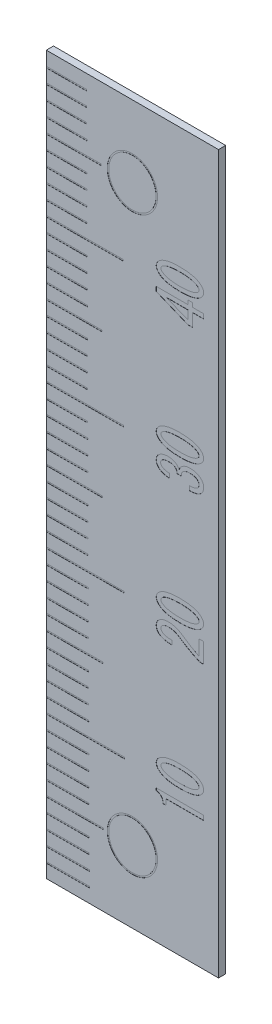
from build123d import *

# Parameters (mm, degrees)
SKETCH1_W      = 12
SKETCH1_H      = 50
EXTRUDE1_DEPTH = 0.5
SKETCH2_R      = 1.75
SKETCH2_R_2    = 1.65
EXTRUDE2_DEPTH = 0.01
EXTRUDE3_DEPTH = 0.01
EXTRUDE4_DEPTH = 0.01


with BuildPart() as part:
    # Sketch1 → Extrude1 (new body)
    with BuildSketch(Plane.XY):
        with Locations((6, 25)):
            Rectangle(SKETCH1_W, SKETCH1_H)
    extrude(amount=EXTRUDE1_DEPTH)

    # Sketch2 → Extrude2 (cut)
    # profile 1 of 2: a face of its own
    with BuildSketch(Plane.XY.offset(0.5)):
        with Locations((6, 5)):
            Circle(SKETCH2_R)
        with Locations((6, 5)):
            Circle(SKETCH2_R_2, mode=Mode.SUBTRACT)
    # profile 2 of 2: a face of its own
    with BuildSketch(Plane.XY.offset(0.5)):
        with Locations((6, 45)):
            Circle(SKETCH2_R)
        with Locations((6, 45)):
            Circle(SKETCH2_R_2, mode=Mode.SUBTRACT)
    extrude(amount=-EXTRUDE2_DEPTH, mode=Mode.SUBTRACT)

    # Sketch3 → Extrude3 (cut)
    # profile 1 of 8: a face of its own
    with BuildSketch(Plane.XY.offset(0.5)):
        Polygon((10.964202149, 39.253595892), (10.576078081, 39.253595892), (10.18481385, 39.253595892), (10.18481385, 38.358021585), (9.863889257, 38.358021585), (7.659495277, 39.263016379), (7.659495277, 39.57326442), (9.863889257, 39.57326442), (9.863889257, 39.857135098), (10.18481385, 39.857135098), (10.18481385, 39.57326442), (10.964202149, 39.57326442), align=None)
        Polygon((9.863889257, 39.253595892), (8.371684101, 39.253595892), (9.863889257, 38.655080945), align=None, mode=Mode.SUBTRACT)
    # profile 2 of 8: a face of its own
    with BuildSketch(Plane.XY.offset(0.5)):
        with BuildLine():
            add(Edge.make_bspline(
                [(9.304312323, 40.08636695), (9.263487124, 40.086598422), (9.183284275, 40.087053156), (9.065184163, 40.090916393), (8.951677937, 40.097059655), (8.842790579, 40.105920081), (8.738418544, 40.116877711), (8.638826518, 40.131643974), (8.543659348, 40.147711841), (8.453367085, 40.166540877), (8.367534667, 40.187646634), (8.286660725, 40.212475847), (8.209981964, 40.238496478), (8.13792646, 40.267351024), (8.071052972, 40.299483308), (8.008231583, 40.333293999), (7.950513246, 40.370357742), (7.914537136, 40.397244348), (7.896891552, 40.410431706)],
                knots=[0, 0, 0, 0, 1.334199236, 2.621091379, 3.861325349, 5.048806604, 6.191184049, 7.29033474, 8.338632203, 9.344988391, 10.304094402, 11.226124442, 12.10888774, 12.949942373, 13.760906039, 14.53244093, 15.280190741, 16, 16, 16, 16], degree=3))
            add(Edge.make_bspline(
                [(7.896891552, 40.410431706), (7.877886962, 40.425936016), (7.841081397, 40.455962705), (7.793642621, 40.506288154), (7.75209867, 40.556343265), (7.718531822, 40.608467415), (7.691781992, 40.661574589), (7.673561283, 40.716630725), (7.661657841, 40.77250316), (7.660214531, 40.810429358), (7.659495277, 40.829329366)],
                knots=[0, 0, 0, 0, 1.179273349, 2.283859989, 3.322502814, 4.306324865, 5.261663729, 6.17616916, 7.091118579, 8, 8, 8, 8], degree=3))
            add(Edge.make_bspline(
                [(7.659495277, 40.829329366), (7.660212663, 40.848230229), (7.661652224, 40.886158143), (7.67358392, 40.942017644), (7.691636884, 40.996945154), (7.718688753, 41.049705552), (7.752296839, 41.101723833), (7.793217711, 41.152330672), (7.841340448, 41.202029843), (7.877935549, 41.232049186), (7.896891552, 41.247598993)],
                knots=[0, 0, 0, 0, 0.909839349, 1.825753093, 2.741222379, 3.688535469, 4.673394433, 5.720979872, 6.819483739, 8, 8, 8, 8], degree=3))
            add(Edge.make_bspline(
                [(7.896891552, 41.247598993), (7.914537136, 41.260786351), (7.950513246, 41.287672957), (8.008231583, 41.3247367), (8.071052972, 41.358547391), (8.13792646, 41.390679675), (8.209981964, 41.419534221), (8.286660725, 41.445554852), (8.367534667, 41.470384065), (8.453367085, 41.491489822), (8.543659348, 41.510318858), (8.638826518, 41.526386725), (8.738418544, 41.541152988), (8.842790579, 41.552110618), (8.951677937, 41.560971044), (9.065184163, 41.567114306), (9.183284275, 41.570977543), (9.263487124, 41.571432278), (9.304312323, 41.571663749)],
                knots=[0, 0, 0, 0, 0.719809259, 1.46755907, 2.239093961, 3.050057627, 3.89111226, 4.773875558, 5.695905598, 6.655011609, 7.661367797, 8.70966526, 9.808815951, 10.951193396, 12.138674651, 13.378908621, 14.665800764, 16, 16, 16, 16], degree=3))
            add(Edge.make_bspline(
                [(9.304312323, 41.571663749), (9.345974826, 41.571432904), (9.427642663, 41.570980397), (9.547627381, 41.567132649), (9.662805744, 41.560946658), (9.773365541, 41.552091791), (9.879218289, 41.541255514), (9.980042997, 41.52631378), (10.076267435, 41.510328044), (10.167806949, 41.49146689), (10.25471717, 41.470480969), (10.336402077, 41.445542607), (10.413707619, 41.419531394), (10.486394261, 41.390685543), (10.553875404, 41.358519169), (10.617234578, 41.324907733), (10.675058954, 41.28765614), (10.711041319, 41.260780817), (10.728689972, 41.247598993)],
                knots=[0, 0, 0, 0, 1.346341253, 2.639130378, 3.8790076, 5.073442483, 6.223226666, 7.316783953, 8.366697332, 9.375051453, 10.336565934, 11.254764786, 12.134057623, 12.971986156, 13.779994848, 14.548849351, 15.288238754, 16, 16, 16, 16], degree=3))
            add(Edge.make_bspline(
                [(10.728689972, 41.247598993), (10.747351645, 41.231964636), (10.783604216, 41.201592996), (10.832476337, 41.152791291), (10.872490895, 41.101447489), (10.906527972, 41.049937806), (10.932289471, 40.996615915), (10.951811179, 40.942259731), (10.962410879, 40.886054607), (10.964024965, 40.848209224), (10.964830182, 40.829329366)],
                knots=[0, 0, 0, 0, 1.1743338, 2.28128622, 3.323893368, 4.309986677, 5.254013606, 6.173907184, 7.08902033, 8, 8, 8, 8], degree=3))
            add(Edge.make_bspline(
                [(10.964830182, 40.829329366), (10.964023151, 40.81045032), (10.962405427, 40.772606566), (10.95183315, 40.716389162), (10.932141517, 40.661902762), (10.906685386, 40.608236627), (10.872691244, 40.556620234), (10.832051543, 40.505827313), (10.783860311, 40.456400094), (10.747399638, 40.426020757), (10.728689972, 40.410431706)],
                knots=[0, 0, 0, 0, 0.910025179, 1.824179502, 2.743109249, 3.69522398, 4.680284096, 5.713901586, 6.826896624, 8, 8, 8, 8], degree=3))
            add(Edge.make_bspline(
                [(10.728689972, 40.410431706), (10.711041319, 40.397249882), (10.675058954, 40.370374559), (10.617234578, 40.333122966), (10.553875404, 40.29951153), (10.486394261, 40.267345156), (10.413707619, 40.238499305), (10.336402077, 40.212488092), (10.25471717, 40.18754973), (10.167806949, 40.166563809), (10.076267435, 40.147702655), (9.980042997, 40.131716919), (9.879218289, 40.116775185), (9.773365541, 40.105938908), (9.662805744, 40.097084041), (9.547627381, 40.09089805), (9.427642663, 40.087050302), (9.345974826, 40.086597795), (9.304312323, 40.08636695)],
                knots=[0, 0, 0, 0, 0.711761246, 1.451150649, 2.220005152, 3.028013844, 3.865942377, 4.745235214, 5.663434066, 6.624948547, 7.633302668, 8.683216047, 9.776773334, 10.926557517, 12.1209924, 13.360869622, 14.653658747, 16, 16, 16, 16], degree=3))
        make_face()
        with BuildLine():
            add(Edge.make_bspline(
                [(9.304312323, 41.261415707), (9.267676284, 41.261069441), (9.195861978, 41.260390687), (9.090316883, 41.258165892), (8.989150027, 41.253278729), (8.892481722, 41.245290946), (8.80022693, 41.237179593), (8.712814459, 41.225295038), (8.629718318, 41.213328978), (8.551258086, 41.197943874), (8.47692929, 41.181420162), (8.407398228, 41.16150603), (8.341873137, 41.141413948), (8.281453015, 41.117852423), (8.225379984, 41.092883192), (8.173815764, 41.065786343), (8.126168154, 41.037204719), (8.097468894, 41.015283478), (8.083417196, 41.004550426)],
                knots=[0, 0, 0, 0, 1.387476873, 2.71974516, 3.997715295, 5.222316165, 6.392993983, 7.5041764, 8.562605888, 9.571696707, 10.531368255, 11.445041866, 12.310057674, 13.125709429, 13.899281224, 14.633331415, 15.330853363, 16, 16, 16, 16], degree=3))
            add(Edge.make_bspline(
                [(8.083417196, 41.004550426), (8.067942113, 40.991309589), (8.038992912, 40.966539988), (8.006840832, 40.922559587), (7.985224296, 40.87705391), (7.982844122, 40.845041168), (7.981675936, 40.829329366)],
                knots=[0, 0, 0, 0, 1.162721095, 2.175099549, 3.10434177, 4, 4, 4, 4], degree=3))
            add(Edge.make_bspline(
                [(7.981675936, 40.829329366), (7.982836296, 40.813611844), (7.985200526, 40.781587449), (8.007018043, 40.736019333), (8.038753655, 40.691521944), (8.067903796, 40.666693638), (8.083417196, 40.653480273)],
                knots=[0, 0, 0, 0, 0.893494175, 1.820491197, 2.840088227, 4, 4, 4, 4], degree=3))
            add(Edge.make_bspline(
                [(8.083417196, 40.653480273), (8.098156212, 40.643035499), (8.128454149, 40.621564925), (8.177291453, 40.592299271), (8.230299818, 40.565060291), (8.287887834, 40.540907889), (8.349363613, 40.517529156), (8.415145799, 40.496237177), (8.485227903, 40.477516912), (8.559390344, 40.460570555), (8.637959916, 40.445608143), (8.720652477, 40.432335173), (8.807623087, 40.421817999), (8.898748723, 40.413272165), (8.994176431, 40.405404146), (9.093874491, 40.400498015), (9.197746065, 40.398267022), (9.268304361, 40.397589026), (9.304312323, 40.397243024)],
                knots=[0, 0, 0, 0, 0.684573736, 1.407229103, 2.156074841, 2.941731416, 3.772993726, 4.648817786, 5.561264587, 6.521855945, 7.531913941, 8.592575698, 9.69595549, 10.851956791, 12.06190895, 13.325252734, 14.634998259, 16, 16, 16, 16], degree=3))
            add(Edge.make_bspline(
                [(9.304312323, 40.397243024), (9.341785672, 40.397588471), (9.415065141, 40.398263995), (9.522703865, 40.400490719), (9.625541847, 40.405385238), (9.723691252, 40.413273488), (9.817323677, 40.421841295), (9.906404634, 40.432229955), (9.990753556, 40.445635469), (10.070391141, 40.460491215), (10.145369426, 40.477539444), (10.215901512, 40.496147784), (10.281702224, 40.517419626), (10.342729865, 40.540898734), (10.399661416, 40.565104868), (10.451853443, 40.591966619), (10.49904188, 40.621590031), (10.528053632, 40.643045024), (10.542164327, 40.653480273)],
                knots=[0, 0, 0, 0, 1.401046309, 2.739758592, 4.0248449, 5.249399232, 6.420696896, 7.540008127, 8.601571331, 9.613140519, 10.568176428, 11.475655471, 12.339456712, 13.151990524, 13.919674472, 14.651282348, 15.344012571, 16, 16, 16, 16], degree=3))
            add(Edge.make_bspline(
                [(10.542164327, 40.653480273), (10.557596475, 40.666746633), (10.586687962, 40.691755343), (10.619429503, 40.735654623), (10.640196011, 40.781762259), (10.642682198, 40.813642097), (10.643905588, 40.829329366)],
                knots=[0, 0, 0, 0, 1.159232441, 2.18529495, 3.107029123, 4, 4, 4, 4], degree=3))
            add(Edge.make_bspline(
                [(10.643905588, 40.829329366), (10.642674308, 40.845010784), (10.640172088, 40.876878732), (10.619603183, 40.922925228), (10.586449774, 40.966304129), (10.557558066, 40.991255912), (10.542164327, 41.004550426)],
                knots=[0, 0, 0, 0, 0.89511734, 1.819067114, 2.837981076, 4, 4, 4, 4], degree=3))
            add(Edge.make_bspline(
                [(10.542164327, 41.004550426), (10.528109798, 41.015278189), (10.499404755, 41.037188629), (10.45164342, 41.065951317), (10.399548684, 41.092855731), (10.342868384, 41.117856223), (10.281814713, 41.14140776), (10.215668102, 41.161504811), (10.14550559, 41.181409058), (10.070358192, 41.198018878), (9.990830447, 41.213306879), (9.906283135, 41.225349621), (9.817389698, 41.237124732), (9.72367965, 41.245296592), (9.625545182, 41.253298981), (9.522702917, 41.258160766), (9.415065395, 41.26039668), (9.341785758, 41.261070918), (9.304312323, 41.261415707)],
                knots=[0, 0, 0, 0, 0.660466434, 1.348940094, 2.080407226, 2.851088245, 3.663465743, 4.524722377, 5.434082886, 6.388935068, 7.400309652, 8.46048529, 9.580538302, 10.751610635, 11.975929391, 13.260768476, 14.599223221, 16, 16, 16, 16], degree=3))
        make_face(mode=Mode.SUBTRACT)
    # profile 3 of 8: a face of its own
    with BuildSketch(Plane.XY.offset(0.5)):
        with BuildLine():
            add(Edge.make_bspline(
                [(9.982587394, 28.709091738), (10.012525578, 28.708287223), (10.070543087, 28.706728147), (10.154420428, 28.710760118), (10.232130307, 28.718455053), (10.303298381, 28.73168567), (10.368273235, 28.749141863), (10.427053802, 28.770782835), (10.479378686, 28.79791141), (10.510164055, 28.820091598), (10.525207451, 28.830930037)],
                knots=[0, 0, 0, 0, 1.267087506, 2.455501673, 3.55133733, 4.569646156, 5.515332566, 6.395721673, 7.21606285, 8, 8, 8, 8], degree=3))
            add(Edge.make_bspline(
                [(10.525207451, 28.830930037), (10.543506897, 28.847280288), (10.579345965, 28.8793019), (10.617183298, 28.941459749), (10.639871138, 29.011713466), (10.642530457, 29.061449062), (10.643905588, 29.087167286)],
                knots=[0, 0, 0, 0, 1.002413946, 1.963205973, 2.946775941, 4, 4, 4, 4], degree=3))
            add(Edge.make_bspline(
                [(10.643905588, 29.087167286), (10.64205895, 29.10966892), (10.638250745, 29.15607263), (10.60631016, 29.222801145), (10.557507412, 29.287350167), (10.514319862, 29.324320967), (10.491293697, 29.344032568)],
                knots=[0, 0, 0, 0, 0.87119639, 1.796613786, 2.82522778, 4, 4, 4, 4], degree=3))
            add(Edge.make_bspline(
                [(10.491293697, 29.344032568), (10.477715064, 29.35383947), (10.449615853, 29.374133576), (10.40102721, 29.398039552), (10.347048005, 29.41973801), (10.286272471, 29.436247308), (10.219328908, 29.449449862), (10.146079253, 29.458528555), (10.066417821, 29.464292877), (10.011278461, 29.464917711), (9.982587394, 29.465242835)],
                knots=[0, 0, 0, 0, 0.754595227, 1.561536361, 2.43511806, 3.377163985, 4.397951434, 5.512234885, 6.705522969, 8, 8, 8, 8], degree=3))
            add(Edge.make_bspline(
                [(9.982587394, 29.465242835), (9.960377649, 29.46473344), (9.916687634, 29.463731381), (9.85267071, 29.456647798), (9.791236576, 29.44559945), (9.732735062, 29.428991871), (9.676430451, 29.40846888), (9.623062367, 29.382368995), (9.571883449, 29.352579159), (9.540443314, 29.328863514), (9.524751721, 29.317027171)],
                knots=[0, 0, 0, 0, 1.086352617, 2.137024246, 3.147391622, 4.136355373, 5.10847195, 6.074961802, 7.039224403, 8, 8, 8, 8], degree=3))
            add(Edge.make_bspline(
                [(9.524751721, 29.317027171), (9.514022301, 29.307663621), (9.492758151, 29.289106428), (9.465670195, 29.256771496), (9.44319759, 29.221167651), (9.426529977, 29.181802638), (9.413593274, 29.139332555), (9.406578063, 29.093273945), (9.403067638, 29.044064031), (9.405038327, 29.010337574), (9.406053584, 28.992962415)],
                knots=[0, 0, 0, 0, 0.947861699, 1.87852391, 2.799832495, 3.743268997, 4.71875736, 5.750864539, 6.841292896, 8, 8, 8, 8], degree=3))
            Line((9.406053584, 28.992962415), (9.117786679, 28.992962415))
            add(Edge.make_bspline(
                [(9.117786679, 28.992962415), (9.115917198, 29.01036469), (9.11227151, 29.044300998), (9.103170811, 29.09366086), (9.089082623, 29.139312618), (9.072365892, 29.182135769), (9.050836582, 29.220887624), (9.026138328, 29.256550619), (8.997813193, 29.288974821), (8.976089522, 29.307646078), (8.965174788, 29.317027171)],
                knots=[0, 0, 0, 0, 1.139052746, 2.221275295, 3.260086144, 4.244297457, 5.207730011, 6.137529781, 7.064229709, 8, 8, 8, 8], degree=3))
            add(Edge.make_bspline(
                [(8.965174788, 29.317027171), (8.953430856, 29.325692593), (8.929384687, 29.343435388), (8.888683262, 29.365118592), (8.844024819, 29.38418922), (8.794826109, 29.398815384), (8.741812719, 29.411043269), (8.684417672, 29.41879032), (8.62278159, 29.423939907), (8.580202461, 29.42467109), (8.558209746, 29.425048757)],
                knots=[0, 0, 0, 0, 0.816014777, 1.670822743, 2.574059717, 3.530392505, 4.539613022, 5.616822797, 6.769055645, 8, 8, 8, 8], degree=3))
            add(Edge.make_bspline(
                [(8.558209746, 29.425048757), (8.530985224, 29.424710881), (8.478357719, 29.424057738), (8.402231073, 29.418395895), (8.331762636, 29.409047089), (8.266898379, 29.396390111), (8.208285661, 29.3784051), (8.154956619, 29.358063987), (8.10766056, 29.33316966), (8.079858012, 29.312952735), (8.06646032, 29.303210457)],
                knots=[0, 0, 0, 0, 1.267211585, 2.44963652, 3.550842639, 4.575246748, 5.5217347, 6.401234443, 7.229575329, 8, 8, 8, 8], degree=3))
            add(Edge.make_bspline(
                [(8.06646032, 29.303210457), (8.050800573, 29.289680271), (8.020516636, 29.263514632), (7.989112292, 29.21338768), (7.967772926, 29.159180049), (7.965751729, 29.120663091), (7.964719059, 29.100984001)],
                knots=[0, 0, 0, 0, 1.053722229, 2.037763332, 2.997453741, 4, 4, 4, 4], degree=3))
            add(Edge.make_bspline(
                [(7.964719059, 29.100984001), (7.965793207, 29.081323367), (7.967906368, 29.0426452), (7.988749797, 28.988170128), (8.020925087, 28.938367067), (8.050860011, 28.911914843), (8.06646032, 28.898129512)],
                knots=[0, 0, 0, 0, 1.000412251, 1.968100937, 2.94109465, 4, 4, 4, 4], degree=3))
            add(Edge.make_bspline(
                [(8.06646032, 28.898129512), (8.081277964, 28.887055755), (8.111428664, 28.864523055), (8.162612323, 28.837488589), (8.218046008, 28.812216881), (8.279698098, 28.793150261), (8.345928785, 28.775455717), (8.417710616, 28.763754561), (8.494531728, 28.75366975), (8.547707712, 28.75119286), (8.575166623, 28.749913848)],
                knots=[0, 0, 0, 0, 0.823448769, 1.675540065, 2.573857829, 3.535986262, 4.547798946, 5.627975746, 6.775138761, 8, 8, 8, 8], degree=3))
            Line((8.575166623, 28.749913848), (8.575166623, 28.452854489))
            add(Edge.make_bspline(
                [(8.575166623, 28.452854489), (8.539320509, 28.454383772), (8.469081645, 28.457380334), (8.36662153, 28.471341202), (8.269148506, 28.489228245), (8.177509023, 28.515831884), (8.090488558, 28.54647123), (8.009243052, 28.585395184), (7.932662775, 28.629471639), (7.886090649, 28.664635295), (7.862977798, 28.682086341)],
                knots=[0, 0, 0, 0, 1.130465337, 2.215096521, 3.257023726, 4.251490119, 5.220175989, 6.161913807, 7.087793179, 8, 8, 8, 8], degree=3))
            add(Edge.make_bspline(
                [(7.862977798, 28.682086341), (7.8467956, 28.695809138), (7.81513049, 28.722661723), (7.772968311, 28.767477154), (7.738724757, 28.816404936), (7.709237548, 28.867139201), (7.68725208, 28.92158891), (7.670766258, 28.978543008), (7.661240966, 29.038909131), (7.660084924, 29.080016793), (7.659495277, 29.100984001)],
                knots=[0, 0, 0, 0, 1.054146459, 2.062739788, 3.04727221, 4.0164563, 4.972878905, 5.957576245, 6.958249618, 8, 8, 8, 8], degree=3))
            add(Edge.make_bspline(
                [(7.659495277, 29.100984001), (7.660084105, 29.122995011), (7.661233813, 29.165972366), (7.67065538, 29.228867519), (7.687412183, 29.288028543), (7.708926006, 29.344536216), (7.738532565, 29.396768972), (7.773183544, 29.446397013), (7.814699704, 29.492477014), (7.846729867, 29.519408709), (7.862977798, 29.533070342)],
                knots=[0, 0, 0, 0, 1.066551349, 2.082482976, 3.072030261, 4.042353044, 5.005167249, 5.973525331, 6.972030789, 8, 8, 8, 8], degree=3))
            add(Edge.make_bspline(
                [(7.862977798, 29.533070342), (7.883180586, 29.548391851), (7.923800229, 29.579197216), (7.99101211, 29.617407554), (8.063031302, 29.649133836), (8.139054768, 29.676462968), (8.220201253, 29.697274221), (8.306188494, 29.711237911), (8.396823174, 29.720285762), (8.458748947, 29.721491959), (8.490382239, 29.722108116)],
                knots=[0, 0, 0, 0, 0.910342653, 1.830331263, 2.769796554, 3.735781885, 4.730142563, 5.775142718, 6.863485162, 8, 8, 8, 8], degree=3))
            add(Edge.make_bspline(
                [(8.490382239, 29.722108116), (8.519286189, 29.72161156), (8.575295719, 29.720649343), (8.656472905, 29.713669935), (8.732474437, 29.70249683), (8.803229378, 29.686672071), (8.868446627, 29.664650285), (8.928974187, 29.640082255), (8.984286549, 29.610093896), (9.016949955, 29.585400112), (9.033002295, 29.57326442)],
                knots=[0, 0, 0, 0, 1.210143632, 2.344993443, 3.40861805, 4.424997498, 5.37575867, 6.287368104, 7.158331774, 8, 8, 8, 8], degree=3))
            add(Edge.make_bspline(
                [(9.033002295, 29.57326442), (9.059175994, 29.551536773), (9.108490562, 29.51059913), (9.171793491, 29.445781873), (9.221317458, 29.38266922), (9.243208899, 29.337936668), (9.253441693, 29.317027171)],
                knots=[0, 0, 0, 0, 1.195517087, 2.252505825, 3.183162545, 4, 4, 4, 4], degree=3))
            add(Edge.make_bspline(
                [(9.253441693, 29.317027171), (9.265088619, 29.34500906), (9.287538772, 29.398945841), (9.331763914, 29.47199791), (9.381380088, 29.535717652), (9.420772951, 29.570253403), (9.439967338, 29.587081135)],
                knots=[0, 0, 0, 0, 1.094399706, 2.109521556, 3.078854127, 4, 4, 4, 4], degree=3))
            add(Edge.make_bspline(
                [(9.439967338, 29.587081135), (9.459994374, 29.60234586), (9.499821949, 29.632702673), (9.564355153, 29.670989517), (9.632227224, 29.703077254), (9.702874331, 29.730156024), (9.776856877, 29.751027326), (9.854027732, 29.765256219), (9.934226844, 29.774233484), (9.988843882, 29.775485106), (10.016501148, 29.776118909)],
                knots=[0, 0, 0, 0, 0.976244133, 1.941447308, 2.904084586, 3.885987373, 4.873249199, 5.881498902, 6.927222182, 8, 8, 8, 8], degree=3))
            add(Edge.make_bspline(
                [(10.016501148, 29.776118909), (10.052324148, 29.77559206), (10.122443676, 29.774560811), (10.225084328, 29.764261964), (10.322576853, 29.747624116), (10.414506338, 29.72361205), (10.501245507, 29.69357359), (10.582537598, 29.656250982), (10.659144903, 29.612707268), (10.705595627, 29.577553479), (10.728689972, 29.560075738)],
                knots=[0, 0, 0, 0, 1.13285732, 2.217441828, 3.259318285, 4.258350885, 5.219645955, 6.158999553, 7.084692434, 8, 8, 8, 8], degree=3))
            add(Edge.make_bspline(
                [(10.728689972, 29.560075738), (10.747408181, 29.544073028), (10.784031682, 29.512762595), (10.832853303, 29.461250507), (10.873280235, 29.40591535), (10.906871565, 29.348128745), (10.932721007, 29.287091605), (10.951971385, 29.223397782), (10.962541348, 29.156184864), (10.964058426, 29.110438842), (10.964830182, 29.087167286)],
                knots=[0, 0, 0, 0, 1.078182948, 2.109541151, 3.099814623, 4.073306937, 5.030426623, 5.996463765, 6.980776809, 8, 8, 8, 8], degree=3))
            add(Edge.make_bspline(
                [(10.964830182, 29.087167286), (10.964367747, 29.062001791), (10.963461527, 29.012685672), (10.952274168, 28.941195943), (10.935512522, 28.873719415), (10.911441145, 28.810497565), (10.88066456, 28.751121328), (10.842591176, 28.696168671), (10.797876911, 28.645289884), (10.763207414, 28.615937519), (10.745646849, 28.601070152)],
                knots=[0, 0, 0, 0, 1.091653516, 2.139282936, 3.133504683, 4.105839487, 5.069340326, 6.029921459, 7.002128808, 8, 8, 8, 8], degree=3))
            add(Edge.make_bspline(
                [(10.745646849, 28.601070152), (10.723356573, 28.584883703), (10.677849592, 28.551838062), (10.601818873, 28.510403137), (10.51783525, 28.476087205), (10.426096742, 28.448030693), (10.326687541, 28.425207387), (10.21890008, 28.410072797), (10.103344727, 28.400491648), (10.023639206, 28.399403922), (9.982587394, 28.398843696)],
                knots=[0, 0, 0, 0, 0.821972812, 1.678108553, 2.577822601, 3.526913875, 4.539938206, 5.620279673, 6.774340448, 8, 8, 8, 8], degree=3))
            Line((9.982587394, 28.398843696), (9.982587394, 28.709091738))
        make_face()
    # profile 4 of 8: a face of its own
    with BuildSketch(Plane.XY.offset(0.5)):
        with BuildLine():
            add(Edge.make_bspline(
                [(9.304312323, 30.08636695), (9.263487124, 30.086598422), (9.183284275, 30.087053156), (9.065184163, 30.090916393), (8.951677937, 30.097059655), (8.842790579, 30.105920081), (8.738418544, 30.116877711), (8.638826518, 30.131643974), (8.543659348, 30.147711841), (8.453367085, 30.166540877), (8.367534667, 30.187646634), (8.286660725, 30.212475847), (8.209981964, 30.238496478), (8.13792646, 30.267351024), (8.071052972, 30.299483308), (8.008231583, 30.333293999), (7.950513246, 30.370357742), (7.914537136, 30.397244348), (7.896891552, 30.410431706)],
                knots=[0, 0, 0, 0, 1.334199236, 2.621091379, 3.861325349, 5.048806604, 6.191184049, 7.29033474, 8.338632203, 9.344988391, 10.304094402, 11.226124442, 12.10888774, 12.949942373, 13.760906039, 14.53244093, 15.280190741, 16, 16, 16, 16], degree=3))
            add(Edge.make_bspline(
                [(7.896891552, 30.410431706), (7.877886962, 30.425936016), (7.841081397, 30.455962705), (7.793642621, 30.506288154), (7.75209867, 30.556343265), (7.718531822, 30.608467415), (7.691781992, 30.661574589), (7.673561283, 30.716630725), (7.661657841, 30.77250316), (7.660214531, 30.810429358), (7.659495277, 30.829329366)],
                knots=[0, 0, 0, 0, 1.179273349, 2.283859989, 3.322502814, 4.306324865, 5.261663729, 6.17616916, 7.091118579, 8, 8, 8, 8], degree=3))
            add(Edge.make_bspline(
                [(7.659495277, 30.829329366), (7.660212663, 30.848230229), (7.661652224, 30.886158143), (7.67358392, 30.942017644), (7.691636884, 30.996945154), (7.718688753, 31.049705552), (7.752296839, 31.101723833), (7.793217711, 31.152330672), (7.841340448, 31.202029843), (7.877935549, 31.232049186), (7.896891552, 31.247598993)],
                knots=[0, 0, 0, 0, 0.909839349, 1.825753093, 2.741222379, 3.688535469, 4.673394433, 5.720979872, 6.819483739, 8, 8, 8, 8], degree=3))
            add(Edge.make_bspline(
                [(7.896891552, 31.247598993), (7.914537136, 31.260786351), (7.950513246, 31.287672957), (8.008231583, 31.3247367), (8.071052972, 31.358547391), (8.13792646, 31.390679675), (8.209981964, 31.419534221), (8.286660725, 31.445554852), (8.367534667, 31.470384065), (8.453367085, 31.491489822), (8.543659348, 31.510318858), (8.638826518, 31.526386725), (8.738418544, 31.541152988), (8.842790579, 31.552110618), (8.951677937, 31.560971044), (9.065184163, 31.567114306), (9.183284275, 31.570977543), (9.263487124, 31.571432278), (9.304312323, 31.571663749)],
                knots=[0, 0, 0, 0, 0.719809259, 1.46755907, 2.239093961, 3.050057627, 3.89111226, 4.773875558, 5.695905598, 6.655011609, 7.661367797, 8.70966526, 9.808815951, 10.951193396, 12.138674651, 13.378908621, 14.665800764, 16, 16, 16, 16], degree=3))
            add(Edge.make_bspline(
                [(9.304312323, 31.571663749), (9.345974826, 31.571432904), (9.427642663, 31.570980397), (9.547627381, 31.567132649), (9.662805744, 31.560946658), (9.773365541, 31.552091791), (9.879218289, 31.541255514), (9.980042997, 31.52631378), (10.076267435, 31.510328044), (10.167806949, 31.49146689), (10.25471717, 31.470480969), (10.336402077, 31.445542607), (10.413707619, 31.419531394), (10.486394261, 31.390685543), (10.553875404, 31.358519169), (10.617234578, 31.324907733), (10.675058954, 31.28765614), (10.711041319, 31.260780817), (10.728689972, 31.247598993)],
                knots=[0, 0, 0, 0, 1.346341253, 2.639130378, 3.8790076, 5.073442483, 6.223226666, 7.316783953, 8.366697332, 9.375051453, 10.336565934, 11.254764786, 12.134057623, 12.971986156, 13.779994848, 14.548849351, 15.288238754, 16, 16, 16, 16], degree=3))
            add(Edge.make_bspline(
                [(10.728689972, 31.247598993), (10.747351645, 31.231964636), (10.783604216, 31.201592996), (10.832476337, 31.152791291), (10.872490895, 31.101447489), (10.906527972, 31.049937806), (10.932289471, 30.996615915), (10.951811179, 30.942259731), (10.962410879, 30.886054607), (10.964024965, 30.848209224), (10.964830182, 30.829329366)],
                knots=[0, 0, 0, 0, 1.1743338, 2.28128622, 3.323893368, 4.309986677, 5.254013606, 6.173907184, 7.08902033, 8, 8, 8, 8], degree=3))
            add(Edge.make_bspline(
                [(10.964830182, 30.829329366), (10.964023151, 30.81045032), (10.962405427, 30.772606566), (10.95183315, 30.716389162), (10.932141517, 30.661902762), (10.906685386, 30.608236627), (10.872691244, 30.556620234), (10.832051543, 30.505827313), (10.783860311, 30.456400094), (10.747399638, 30.426020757), (10.728689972, 30.410431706)],
                knots=[0, 0, 0, 0, 0.910025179, 1.824179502, 2.743109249, 3.69522398, 4.680284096, 5.713901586, 6.826896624, 8, 8, 8, 8], degree=3))
            add(Edge.make_bspline(
                [(10.728689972, 30.410431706), (10.711041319, 30.397249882), (10.675058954, 30.370374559), (10.617234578, 30.333122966), (10.553875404, 30.29951153), (10.486394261, 30.267345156), (10.413707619, 30.238499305), (10.336402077, 30.212488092), (10.25471717, 30.18754973), (10.167806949, 30.166563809), (10.076267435, 30.147702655), (9.980042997, 30.131716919), (9.879218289, 30.116775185), (9.773365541, 30.105938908), (9.662805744, 30.097084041), (9.547627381, 30.09089805), (9.427642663, 30.087050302), (9.345974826, 30.086597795), (9.304312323, 30.08636695)],
                knots=[0, 0, 0, 0, 0.711761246, 1.451150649, 2.220005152, 3.028013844, 3.865942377, 4.745235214, 5.663434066, 6.624948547, 7.633302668, 8.683216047, 9.776773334, 10.926557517, 12.1209924, 13.360869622, 14.653658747, 16, 16, 16, 16], degree=3))
        make_face()
        with BuildLine():
            add(Edge.make_bspline(
                [(9.304312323, 31.261415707), (9.267676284, 31.261069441), (9.195861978, 31.260390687), (9.090316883, 31.258165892), (8.989150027, 31.253278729), (8.892481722, 31.245290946), (8.80022693, 31.237179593), (8.712814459, 31.225295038), (8.629718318, 31.213328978), (8.551258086, 31.197943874), (8.47692929, 31.181420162), (8.407398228, 31.16150603), (8.341873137, 31.141413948), (8.281453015, 31.117852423), (8.225379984, 31.092883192), (8.173815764, 31.065786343), (8.126168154, 31.037204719), (8.097468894, 31.015283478), (8.083417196, 31.004550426)],
                knots=[0, 0, 0, 0, 1.387476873, 2.71974516, 3.997715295, 5.222316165, 6.392993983, 7.5041764, 8.562605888, 9.571696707, 10.531368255, 11.445041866, 12.310057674, 13.125709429, 13.899281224, 14.633331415, 15.330853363, 16, 16, 16, 16], degree=3))
            add(Edge.make_bspline(
                [(8.083417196, 31.004550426), (8.067942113, 30.991309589), (8.038992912, 30.966539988), (8.006840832, 30.922559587), (7.985224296, 30.87705391), (7.982844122, 30.845041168), (7.981675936, 30.829329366)],
                knots=[0, 0, 0, 0, 1.162721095, 2.175099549, 3.10434177, 4, 4, 4, 4], degree=3))
            add(Edge.make_bspline(
                [(7.981675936, 30.829329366), (7.982836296, 30.813611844), (7.985200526, 30.781587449), (8.007018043, 30.736019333), (8.038753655, 30.691521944), (8.067903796, 30.666693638), (8.083417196, 30.653480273)],
                knots=[0, 0, 0, 0, 0.893494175, 1.820491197, 2.840088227, 4, 4, 4, 4], degree=3))
            add(Edge.make_bspline(
                [(8.083417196, 30.653480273), (8.098156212, 30.643035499), (8.128454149, 30.621564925), (8.177291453, 30.592299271), (8.230299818, 30.565060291), (8.287887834, 30.540907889), (8.349363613, 30.517529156), (8.415145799, 30.496237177), (8.485227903, 30.477516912), (8.559390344, 30.460570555), (8.637959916, 30.445608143), (8.720652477, 30.432335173), (8.807623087, 30.421817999), (8.898748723, 30.413272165), (8.994176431, 30.405404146), (9.093874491, 30.400498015), (9.197746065, 30.398267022), (9.268304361, 30.397589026), (9.304312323, 30.397243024)],
                knots=[0, 0, 0, 0, 0.684573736, 1.407229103, 2.156074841, 2.941731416, 3.772993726, 4.648817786, 5.561264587, 6.521855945, 7.531913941, 8.592575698, 9.69595549, 10.851956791, 12.06190895, 13.325252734, 14.634998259, 16, 16, 16, 16], degree=3))
            add(Edge.make_bspline(
                [(9.304312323, 30.397243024), (9.341785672, 30.397588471), (9.415065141, 30.398263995), (9.522703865, 30.400490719), (9.625541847, 30.405385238), (9.723691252, 30.413273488), (9.817323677, 30.421841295), (9.906404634, 30.432229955), (9.990753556, 30.445635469), (10.070391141, 30.460491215), (10.145369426, 30.477539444), (10.215901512, 30.496147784), (10.281702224, 30.517419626), (10.342729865, 30.540898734), (10.399661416, 30.565104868), (10.451853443, 30.591966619), (10.49904188, 30.621590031), (10.528053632, 30.643045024), (10.542164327, 30.653480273)],
                knots=[0, 0, 0, 0, 1.401046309, 2.739758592, 4.0248449, 5.249399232, 6.420696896, 7.540008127, 8.601571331, 9.613140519, 10.568176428, 11.475655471, 12.339456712, 13.151990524, 13.919674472, 14.651282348, 15.344012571, 16, 16, 16, 16], degree=3))
            add(Edge.make_bspline(
                [(10.542164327, 30.653480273), (10.557596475, 30.666746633), (10.586687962, 30.691755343), (10.619429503, 30.735654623), (10.640196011, 30.781762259), (10.642682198, 30.813642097), (10.643905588, 30.829329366)],
                knots=[0, 0, 0, 0, 1.159232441, 2.18529495, 3.107029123, 4, 4, 4, 4], degree=3))
            add(Edge.make_bspline(
                [(10.643905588, 30.829329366), (10.642674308, 30.845010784), (10.640172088, 30.876878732), (10.619603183, 30.922925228), (10.586449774, 30.966304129), (10.557558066, 30.991255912), (10.542164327, 31.004550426)],
                knots=[0, 0, 0, 0, 0.89511734, 1.819067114, 2.837981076, 4, 4, 4, 4], degree=3))
            add(Edge.make_bspline(
                [(10.542164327, 31.004550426), (10.528109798, 31.015278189), (10.499404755, 31.037188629), (10.45164342, 31.065951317), (10.399548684, 31.092855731), (10.342868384, 31.117856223), (10.281814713, 31.14140776), (10.215668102, 31.161504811), (10.14550559, 31.181409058), (10.070358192, 31.198018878), (9.990830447, 31.213306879), (9.906283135, 31.225349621), (9.817389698, 31.237124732), (9.72367965, 31.245296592), (9.625545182, 31.253298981), (9.522702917, 31.258160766), (9.415065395, 31.26039668), (9.341785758, 31.261070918), (9.304312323, 31.261415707)],
                knots=[0, 0, 0, 0, 0.660466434, 1.348940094, 2.080407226, 2.851088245, 3.663465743, 4.524722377, 5.434082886, 6.388935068, 7.400309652, 8.46048529, 9.580538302, 10.751610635, 11.975929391, 13.260768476, 14.599223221, 16, 16, 16, 16], degree=3))
        make_face(mode=Mode.SUBTRACT)
    # profile 5 of 8: a face of its own
    with BuildSketch(Plane.XY.offset(0.5)):
        with BuildLine():
            Line((10.643905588, 19.789307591), (10.964830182, 19.789307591))
            Line((10.964830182, 19.789307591), (10.964830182, 18.412032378))
            Line((10.964830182, 18.412032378), (10.694776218, 18.412032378))
            add(Edge.make_bspline(
                [(10.694776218, 18.412032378), (10.634104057, 18.438239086), (10.512820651, 18.490626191), (10.333941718, 18.576059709), (10.15666089, 18.664824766), (9.982086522, 18.759401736), (9.809323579, 18.858008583), (9.638392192, 18.960822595), (9.469988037, 19.068963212), (9.359615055, 19.144268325), (9.304312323, 19.18200019)],
                knots=[0, 0, 0, 0, 0.99614483, 1.991289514, 2.987624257, 3.984438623, 4.983697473, 5.985971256, 6.990864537, 8, 8, 8, 8], degree=3))
            add(Edge.make_bspline(
                [(9.304312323, 19.18200019), (9.273407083, 19.202561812), (9.212458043, 19.24311193), (9.117211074, 19.295150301), (9.021104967, 19.339278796), (8.923672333, 19.375332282), (8.825440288, 19.4035815), (8.72593849, 19.42388529), (8.625513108, 19.436178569), (8.558034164, 19.437551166), (8.524295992, 19.438237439)],
                knots=[0, 0, 0, 0, 1.067918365, 2.106070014, 3.119789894, 4.109153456, 5.093164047, 6.058534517, 7.029304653, 8, 8, 8, 8], degree=3))
            add(Edge.make_bspline(
                [(8.524295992, 19.438237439), (8.501046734, 19.437894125), (8.455732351, 19.437224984), (8.389860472, 19.431518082), (8.328132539, 19.422267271), (8.270797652, 19.409104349), (8.21743613, 19.392320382), (8.168710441, 19.370724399), (8.123431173, 19.346637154), (8.096599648, 19.326782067), (8.083417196, 19.317027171)],
                knots=[0, 0, 0, 0, 1.197973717, 2.334932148, 3.404529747, 4.412096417, 5.3640046, 6.281988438, 7.155932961, 8, 8, 8, 8], degree=3))
            add(Edge.make_bspline(
                [(8.083417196, 19.317027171), (8.067746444, 19.303076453), (8.037248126, 19.275925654), (8.005254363, 19.223199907), (7.984772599, 19.164442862), (7.982726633, 19.122515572), (7.981675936, 19.100984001)],
                knots=[0, 0, 0, 0, 1.01321699, 1.971916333, 2.958486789, 4, 4, 4, 4], degree=3))
            add(Edge.make_bspline(
                [(7.981675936, 19.100984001), (7.983585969, 19.082717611), (7.987575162, 19.044567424), (8.01537348, 18.988943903), (8.059276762, 18.934674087), (8.097036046, 18.902326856), (8.11733095, 18.88494083)],
                knots=[0, 0, 0, 0, 0.831770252, 1.737190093, 2.783782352, 4, 4, 4, 4], degree=3))
            add(Edge.make_bspline(
                [(8.11733095, 18.88494083), (8.13152823, 18.875101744), (8.161915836, 18.854042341), (8.215884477, 18.829594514), (8.27953563, 18.808918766), (8.353234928, 18.792609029), (8.436819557, 18.778578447), (8.530630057, 18.769762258), (8.63433812, 18.764032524), (8.706835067, 18.763421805), (8.74473539, 18.76310253)],
                knots=[0, 0, 0, 0, 0.638255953, 1.36611168, 2.182006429, 3.11234378, 4.156826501, 5.317109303, 6.597424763, 8, 8, 8, 8], degree=3))
            Line((8.74473539, 18.76310253), (8.74473539, 18.466043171))
            add(Edge.make_bspline(
                [(8.74473539, 18.466043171), (8.695515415, 18.46790543), (8.600702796, 18.471492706), (8.463728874, 18.483794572), (8.337426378, 18.503038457), (8.221668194, 18.528812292), (8.116016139, 18.559516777), (8.021404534, 18.598268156), (7.936291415, 18.64179784), (7.886844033, 18.67828985), (7.862977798, 18.695903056)],
                knots=[0, 0, 0, 0, 1.276449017, 2.458828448, 3.562299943, 4.585123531, 5.530965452, 6.409552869, 7.23235602, 8, 8, 8, 8], degree=3))
            add(Edge.make_bspline(
                [(7.862977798, 18.695903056), (7.846729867, 18.709564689), (7.814699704, 18.736496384), (7.773183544, 18.782576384), (7.738532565, 18.832204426), (7.708926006, 18.884437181), (7.687412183, 18.940944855), (7.67065538, 19.000105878), (7.661233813, 19.063001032), (7.660084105, 19.105978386), (7.659495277, 19.127989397)],
                knots=[0, 0, 0, 0, 1.027969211, 2.026474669, 2.994832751, 3.957646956, 4.927969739, 5.917517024, 6.933448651, 8, 8, 8, 8], degree=3))
            add(Edge.make_bspline(
                [(7.659495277, 19.127989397), (7.659956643, 19.148979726), (7.660867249, 19.190408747), (7.672379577, 19.250967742), (7.688861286, 19.309450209), (7.71397118, 19.364787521), (7.74481477, 19.418042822), (7.782906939, 19.468678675), (7.828294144, 19.516390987), (7.862484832, 19.545314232), (7.879934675, 19.560075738)],
                knots=[0, 0, 0, 0, 1.000230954, 1.974175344, 2.932001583, 3.893571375, 4.865053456, 5.864036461, 6.909871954, 8, 8, 8, 8], degree=3))
            add(Edge.make_bspline(
                [(7.879934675, 19.560075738), (7.900321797, 19.575446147), (7.941611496, 19.606575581), (8.010569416, 19.644342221), (8.084899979, 19.676515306), (8.164800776, 19.703727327), (8.25083857, 19.724143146), (8.34261768, 19.738396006), (8.43996472, 19.747294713), (8.506900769, 19.748496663), (8.541252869, 19.749113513)],
                knots=[0, 0, 0, 0, 0.873404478, 1.768891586, 2.683909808, 3.645167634, 4.655436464, 5.707963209, 6.823708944, 8, 8, 8, 8], degree=3))
            add(Edge.make_bspline(
                [(8.541252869, 19.749113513), (8.5825466, 19.747997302), (8.665684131, 19.745750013), (8.7908176, 19.728176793), (8.916613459, 19.69873904), (9.043909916, 19.659401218), (9.171696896, 19.607206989), (9.300597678, 19.544064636), (9.430892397, 19.470149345), (9.515481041, 19.41326659), (9.558665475, 19.384226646)],
                knots=[0, 0, 0, 0, 0.902713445, 1.817451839, 2.756860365, 3.725448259, 4.727634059, 5.771721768, 6.862413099, 8, 8, 8, 8], degree=3))
            add(Edge.make_bspline(
                [(9.558665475, 19.384226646), (9.650692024, 19.32107194), (9.831341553, 19.197098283), (10.105692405, 19.027797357), (10.37414261, 18.87223849), (10.555117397, 18.780905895), (10.643905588, 18.736097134)],
                knots=[0, 0, 0, 0, 1.058433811, 2.077721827, 3.056909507, 4, 4, 4, 4], degree=3))
            Line((10.643905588, 18.736097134), (10.643905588, 19.789307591))
        make_face()
    # profile 6 of 8: a face of its own
    with BuildSketch(Plane.XY.offset(0.5)):
        with BuildLine():
            add(Edge.make_bspline(
                [(9.304312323, 20.08636695), (9.263487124, 20.086598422), (9.183284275, 20.087053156), (9.065184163, 20.090916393), (8.951677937, 20.097059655), (8.842790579, 20.105920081), (8.738418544, 20.116877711), (8.638826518, 20.131643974), (8.543659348, 20.147711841), (8.453367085, 20.166540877), (8.367534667, 20.187646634), (8.286660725, 20.212475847), (8.209981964, 20.238496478), (8.13792646, 20.267351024), (8.071052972, 20.299483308), (8.008231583, 20.333293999), (7.950513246, 20.370357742), (7.914537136, 20.397244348), (7.896891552, 20.410431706)],
                knots=[0, 0, 0, 0, 1.334199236, 2.621091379, 3.861325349, 5.048806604, 6.191184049, 7.29033474, 8.338632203, 9.344988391, 10.304094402, 11.226124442, 12.10888774, 12.949942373, 13.760906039, 14.53244093, 15.280190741, 16, 16, 16, 16], degree=3))
            add(Edge.make_bspline(
                [(7.896891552, 20.410431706), (7.877886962, 20.425936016), (7.841081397, 20.455962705), (7.793642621, 20.506288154), (7.75209867, 20.556343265), (7.718531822, 20.608467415), (7.691781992, 20.661574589), (7.673561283, 20.716630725), (7.661657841, 20.77250316), (7.660214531, 20.810429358), (7.659495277, 20.829329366)],
                knots=[0, 0, 0, 0, 1.179273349, 2.283859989, 3.322502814, 4.306324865, 5.261663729, 6.17616916, 7.091118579, 8, 8, 8, 8], degree=3))
            add(Edge.make_bspline(
                [(7.659495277, 20.829329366), (7.660212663, 20.848230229), (7.661652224, 20.886158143), (7.67358392, 20.942017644), (7.691636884, 20.996945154), (7.718688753, 21.049705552), (7.752296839, 21.101723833), (7.793217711, 21.152330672), (7.841340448, 21.202029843), (7.877935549, 21.232049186), (7.896891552, 21.247598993)],
                knots=[0, 0, 0, 0, 0.909839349, 1.825753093, 2.741222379, 3.688535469, 4.673394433, 5.720979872, 6.819483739, 8, 8, 8, 8], degree=3))
            add(Edge.make_bspline(
                [(7.896891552, 21.247598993), (7.914537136, 21.260786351), (7.950513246, 21.287672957), (8.008231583, 21.3247367), (8.071052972, 21.358547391), (8.13792646, 21.390679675), (8.209981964, 21.419534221), (8.286660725, 21.445554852), (8.367534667, 21.470384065), (8.453367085, 21.491489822), (8.543659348, 21.510318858), (8.638826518, 21.526386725), (8.738418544, 21.541152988), (8.842790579, 21.552110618), (8.951677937, 21.560971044), (9.065184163, 21.567114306), (9.183284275, 21.570977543), (9.263487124, 21.571432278), (9.304312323, 21.571663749)],
                knots=[0, 0, 0, 0, 0.719809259, 1.46755907, 2.239093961, 3.050057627, 3.89111226, 4.773875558, 5.695905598, 6.655011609, 7.661367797, 8.70966526, 9.808815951, 10.951193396, 12.138674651, 13.378908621, 14.665800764, 16, 16, 16, 16], degree=3))
            add(Edge.make_bspline(
                [(9.304312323, 21.571663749), (9.345974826, 21.571432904), (9.427642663, 21.570980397), (9.547627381, 21.567132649), (9.662805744, 21.560946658), (9.773365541, 21.552091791), (9.879218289, 21.541255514), (9.980042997, 21.52631378), (10.076267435, 21.510328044), (10.167806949, 21.49146689), (10.25471717, 21.470480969), (10.336402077, 21.445542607), (10.413707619, 21.419531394), (10.486394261, 21.390685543), (10.553875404, 21.358519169), (10.617234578, 21.324907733), (10.675058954, 21.28765614), (10.711041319, 21.260780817), (10.728689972, 21.247598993)],
                knots=[0, 0, 0, 0, 1.346341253, 2.639130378, 3.8790076, 5.073442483, 6.223226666, 7.316783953, 8.366697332, 9.375051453, 10.336565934, 11.254764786, 12.134057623, 12.971986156, 13.779994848, 14.548849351, 15.288238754, 16, 16, 16, 16], degree=3))
            add(Edge.make_bspline(
                [(10.728689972, 21.247598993), (10.747351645, 21.231964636), (10.783604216, 21.201592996), (10.832476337, 21.152791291), (10.872490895, 21.101447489), (10.906527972, 21.049937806), (10.932289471, 20.996615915), (10.951811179, 20.942259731), (10.962410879, 20.886054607), (10.964024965, 20.848209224), (10.964830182, 20.829329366)],
                knots=[0, 0, 0, 0, 1.1743338, 2.28128622, 3.323893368, 4.309986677, 5.254013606, 6.173907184, 7.08902033, 8, 8, 8, 8], degree=3))
            add(Edge.make_bspline(
                [(10.964830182, 20.829329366), (10.964023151, 20.81045032), (10.962405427, 20.772606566), (10.95183315, 20.716389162), (10.932141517, 20.661902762), (10.906685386, 20.608236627), (10.872691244, 20.556620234), (10.832051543, 20.505827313), (10.783860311, 20.456400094), (10.747399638, 20.426020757), (10.728689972, 20.410431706)],
                knots=[0, 0, 0, 0, 0.910025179, 1.824179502, 2.743109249, 3.69522398, 4.680284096, 5.713901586, 6.826896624, 8, 8, 8, 8], degree=3))
            add(Edge.make_bspline(
                [(10.728689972, 20.410431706), (10.711041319, 20.397249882), (10.675058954, 20.370374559), (10.617234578, 20.333122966), (10.553875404, 20.29951153), (10.486394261, 20.267345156), (10.413707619, 20.238499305), (10.336402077, 20.212488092), (10.25471717, 20.18754973), (10.167806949, 20.166563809), (10.076267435, 20.147702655), (9.980042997, 20.131716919), (9.879218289, 20.116775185), (9.773365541, 20.105938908), (9.662805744, 20.097084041), (9.547627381, 20.09089805), (9.427642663, 20.087050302), (9.345974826, 20.086597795), (9.304312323, 20.08636695)],
                knots=[0, 0, 0, 0, 0.711761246, 1.451150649, 2.220005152, 3.028013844, 3.865942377, 4.745235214, 5.663434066, 6.624948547, 7.633302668, 8.683216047, 9.776773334, 10.926557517, 12.1209924, 13.360869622, 14.653658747, 16, 16, 16, 16], degree=3))
        make_face()
        with BuildLine():
            add(Edge.make_bspline(
                [(9.304312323, 21.261415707), (9.267676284, 21.261069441), (9.195861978, 21.260390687), (9.090316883, 21.258165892), (8.989150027, 21.253278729), (8.892481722, 21.245290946), (8.80022693, 21.237179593), (8.712814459, 21.225295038), (8.629718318, 21.213328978), (8.551258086, 21.197943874), (8.47692929, 21.181420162), (8.407398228, 21.16150603), (8.341873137, 21.141413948), (8.281453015, 21.117852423), (8.225379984, 21.092883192), (8.173815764, 21.065786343), (8.126168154, 21.037204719), (8.097468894, 21.015283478), (8.083417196, 21.004550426)],
                knots=[0, 0, 0, 0, 1.387476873, 2.71974516, 3.997715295, 5.222316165, 6.392993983, 7.5041764, 8.562605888, 9.571696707, 10.531368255, 11.445041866, 12.310057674, 13.125709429, 13.899281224, 14.633331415, 15.330853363, 16, 16, 16, 16], degree=3))
            add(Edge.make_bspline(
                [(8.083417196, 21.004550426), (8.067942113, 20.991309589), (8.038992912, 20.966539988), (8.006840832, 20.922559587), (7.985224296, 20.87705391), (7.982844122, 20.845041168), (7.981675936, 20.829329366)],
                knots=[0, 0, 0, 0, 1.162721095, 2.175099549, 3.10434177, 4, 4, 4, 4], degree=3))
            add(Edge.make_bspline(
                [(7.981675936, 20.829329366), (7.982836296, 20.813611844), (7.985200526, 20.781587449), (8.007018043, 20.736019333), (8.038753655, 20.691521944), (8.067903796, 20.666693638), (8.083417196, 20.653480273)],
                knots=[0, 0, 0, 0, 0.893494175, 1.820491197, 2.840088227, 4, 4, 4, 4], degree=3))
            add(Edge.make_bspline(
                [(8.083417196, 20.653480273), (8.098156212, 20.643035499), (8.128454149, 20.621564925), (8.177291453, 20.592299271), (8.230299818, 20.565060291), (8.287887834, 20.540907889), (8.349363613, 20.517529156), (8.415145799, 20.496237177), (8.485227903, 20.477516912), (8.559390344, 20.460570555), (8.637959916, 20.445608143), (8.720652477, 20.432335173), (8.807623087, 20.421817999), (8.898748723, 20.413272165), (8.994176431, 20.405404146), (9.093874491, 20.400498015), (9.197746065, 20.398267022), (9.268304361, 20.397589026), (9.304312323, 20.397243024)],
                knots=[0, 0, 0, 0, 0.684573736, 1.407229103, 2.156074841, 2.941731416, 3.772993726, 4.648817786, 5.561264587, 6.521855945, 7.531913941, 8.592575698, 9.69595549, 10.851956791, 12.06190895, 13.325252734, 14.634998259, 16, 16, 16, 16], degree=3))
            add(Edge.make_bspline(
                [(9.304312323, 20.397243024), (9.341785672, 20.397588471), (9.415065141, 20.398263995), (9.522703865, 20.400490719), (9.625541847, 20.405385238), (9.723691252, 20.413273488), (9.817323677, 20.421841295), (9.906404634, 20.432229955), (9.990753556, 20.445635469), (10.070391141, 20.460491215), (10.145369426, 20.477539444), (10.215901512, 20.496147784), (10.281702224, 20.517419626), (10.342729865, 20.540898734), (10.399661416, 20.565104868), (10.451853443, 20.591966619), (10.49904188, 20.621590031), (10.528053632, 20.643045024), (10.542164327, 20.653480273)],
                knots=[0, 0, 0, 0, 1.401046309, 2.739758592, 4.0248449, 5.249399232, 6.420696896, 7.540008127, 8.601571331, 9.613140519, 10.568176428, 11.475655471, 12.339456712, 13.151990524, 13.919674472, 14.651282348, 15.344012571, 16, 16, 16, 16], degree=3))
            add(Edge.make_bspline(
                [(10.542164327, 20.653480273), (10.557596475, 20.666746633), (10.586687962, 20.691755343), (10.619429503, 20.735654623), (10.640196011, 20.781762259), (10.642682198, 20.813642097), (10.643905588, 20.829329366)],
                knots=[0, 0, 0, 0, 1.159232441, 2.18529495, 3.107029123, 4, 4, 4, 4], degree=3))
            add(Edge.make_bspline(
                [(10.643905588, 20.829329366), (10.642674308, 20.845010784), (10.640172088, 20.876878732), (10.619603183, 20.922925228), (10.586449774, 20.966304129), (10.557558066, 20.991255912), (10.542164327, 21.004550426)],
                knots=[0, 0, 0, 0, 0.89511734, 1.819067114, 2.837981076, 4, 4, 4, 4], degree=3))
            add(Edge.make_bspline(
                [(10.542164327, 21.004550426), (10.528109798, 21.015278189), (10.499404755, 21.037188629), (10.45164342, 21.065951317), (10.399548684, 21.092855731), (10.342868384, 21.117856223), (10.281814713, 21.14140776), (10.215668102, 21.161504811), (10.14550559, 21.181409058), (10.070358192, 21.198018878), (9.990830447, 21.213306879), (9.906283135, 21.225349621), (9.817389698, 21.237124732), (9.72367965, 21.245296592), (9.625545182, 21.253298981), (9.522702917, 21.258160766), (9.415065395, 21.26039668), (9.341785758, 21.261070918), (9.304312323, 21.261415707)],
                knots=[0, 0, 0, 0, 0.660466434, 1.348940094, 2.080407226, 2.851088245, 3.663465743, 4.524722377, 5.434082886, 6.388935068, 7.400309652, 8.46048529, 9.580538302, 10.751610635, 11.975929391, 13.260768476, 14.599223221, 16, 16, 16, 16], degree=3))
        make_face(mode=Mode.SUBTRACT)
    # profile 7 of 8: a face of its own
    with BuildSketch(Plane.XY.offset(0.5)):
        with BuildLine():
            Line((10.964202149, 8.983541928), (9.643449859, 8.983541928))
            Line((9.643449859, 8.983541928), (8.334630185, 8.983541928))
            Line((8.334630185, 8.983541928), (8.334630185, 8.58788147))
            Line((8.334630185, 8.58788147), (8.134287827, 8.58788147))
            add(Edge.make_bspline(
                [(8.134287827, 8.58788147), (8.133949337, 8.607154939), (8.133292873, 8.644533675), (8.127537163, 8.699138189), (8.117992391, 8.750485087), (8.105914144, 8.79930573), (8.088535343, 8.844454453), (8.068559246, 8.887235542), (8.044100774, 8.926478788), (8.016032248, 8.962796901), (7.984633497, 8.996211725), (7.949221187, 9.026469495), (7.910057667, 9.053561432), (7.867120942, 9.077453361), (7.820438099, 9.09818504), (7.770182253, 9.115604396), (7.716225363, 9.130205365), (7.67880858, 9.137442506), (7.659495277, 9.141178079)],
                knots=[0, 0, 0, 0, 1.144858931, 2.220325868, 3.257124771, 4.246590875, 5.202985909, 6.126465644, 7.048017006, 7.94360395, 8.849836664, 9.767181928, 10.705616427, 11.674465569, 12.68221077, 13.736395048, 14.831602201, 16, 16, 16, 16], degree=3))
            Line((7.659495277, 9.141178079), (7.659495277, 9.303210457))
            Line((7.659495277, 9.303210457), (10.964202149, 9.303210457))
            Line((10.964202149, 9.303210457), (10.964202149, 8.983541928))
        make_face()
    # profile 8 of 8: a face of its own
    with BuildSketch(Plane.XY.offset(0.5)):
        with BuildLine():
            add(Edge.make_bspline(
                [(9.304312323, 10.08636695), (9.263487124, 10.086598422), (9.183284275, 10.087053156), (9.065184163, 10.090916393), (8.951677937, 10.097059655), (8.842790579, 10.105920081), (8.738418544, 10.116877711), (8.638826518, 10.131643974), (8.543659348, 10.147711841), (8.453367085, 10.166540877), (8.367534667, 10.187646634), (8.286660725, 10.212475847), (8.209981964, 10.238496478), (8.13792646, 10.267351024), (8.071052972, 10.299483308), (8.008231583, 10.333293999), (7.950513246, 10.370357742), (7.914537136, 10.397244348), (7.896891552, 10.410431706)],
                knots=[0, 0, 0, 0, 1.334199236, 2.621091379, 3.861325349, 5.048806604, 6.191184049, 7.29033474, 8.338632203, 9.344988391, 10.304094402, 11.226124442, 12.10888774, 12.949942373, 13.760906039, 14.53244093, 15.280190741, 16, 16, 16, 16], degree=3))
            add(Edge.make_bspline(
                [(7.896891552, 10.410431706), (7.877886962, 10.425936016), (7.841081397, 10.455962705), (7.793642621, 10.506288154), (7.75209867, 10.556343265), (7.718531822, 10.608467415), (7.691781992, 10.661574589), (7.673561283, 10.716630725), (7.661657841, 10.77250316), (7.660214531, 10.810429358), (7.659495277, 10.829329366)],
                knots=[0, 0, 0, 0, 1.179273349, 2.283859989, 3.322502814, 4.306324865, 5.261663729, 6.17616916, 7.091118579, 8, 8, 8, 8], degree=3))
            add(Edge.make_bspline(
                [(7.659495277, 10.829329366), (7.660212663, 10.848230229), (7.661652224, 10.886158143), (7.67358392, 10.942017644), (7.691636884, 10.996945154), (7.718688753, 11.049705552), (7.752296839, 11.101723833), (7.793217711, 11.152330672), (7.841340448, 11.202029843), (7.877935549, 11.232049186), (7.896891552, 11.247598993)],
                knots=[0, 0, 0, 0, 0.909839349, 1.825753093, 2.741222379, 3.688535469, 4.673394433, 5.720979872, 6.819483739, 8, 8, 8, 8], degree=3))
            add(Edge.make_bspline(
                [(7.896891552, 11.247598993), (7.914537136, 11.260786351), (7.950513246, 11.287672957), (8.008231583, 11.3247367), (8.071052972, 11.358547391), (8.13792646, 11.390679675), (8.209981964, 11.419534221), (8.286660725, 11.445554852), (8.367534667, 11.470384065), (8.453367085, 11.491489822), (8.543659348, 11.510318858), (8.638826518, 11.526386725), (8.738418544, 11.541152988), (8.842790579, 11.552110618), (8.951677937, 11.560971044), (9.065184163, 11.567114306), (9.183284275, 11.570977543), (9.263487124, 11.571432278), (9.304312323, 11.571663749)],
                knots=[0, 0, 0, 0, 0.719809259, 1.46755907, 2.239093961, 3.050057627, 3.89111226, 4.773875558, 5.695905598, 6.655011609, 7.661367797, 8.70966526, 9.808815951, 10.951193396, 12.138674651, 13.378908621, 14.665800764, 16, 16, 16, 16], degree=3))
            add(Edge.make_bspline(
                [(9.304312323, 11.571663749), (9.345974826, 11.571432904), (9.427642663, 11.570980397), (9.547627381, 11.567132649), (9.662805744, 11.560946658), (9.773365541, 11.552091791), (9.879218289, 11.541255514), (9.980042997, 11.52631378), (10.076267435, 11.510328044), (10.167806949, 11.49146689), (10.25471717, 11.470480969), (10.336402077, 11.445542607), (10.413707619, 11.419531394), (10.486394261, 11.390685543), (10.553875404, 11.358519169), (10.617234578, 11.324907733), (10.675058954, 11.28765614), (10.711041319, 11.260780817), (10.728689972, 11.247598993)],
                knots=[0, 0, 0, 0, 1.346341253, 2.639130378, 3.8790076, 5.073442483, 6.223226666, 7.316783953, 8.366697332, 9.375051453, 10.336565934, 11.254764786, 12.134057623, 12.971986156, 13.779994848, 14.548849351, 15.288238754, 16, 16, 16, 16], degree=3))
            add(Edge.make_bspline(
                [(10.728689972, 11.247598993), (10.747351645, 11.231964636), (10.783604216, 11.201592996), (10.832476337, 11.152791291), (10.872490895, 11.101447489), (10.906527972, 11.049937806), (10.932289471, 10.996615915), (10.951811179, 10.942259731), (10.962410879, 10.886054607), (10.964024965, 10.848209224), (10.964830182, 10.829329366)],
                knots=[0, 0, 0, 0, 1.1743338, 2.28128622, 3.323893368, 4.309986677, 5.254013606, 6.173907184, 7.08902033, 8, 8, 8, 8], degree=3))
            add(Edge.make_bspline(
                [(10.964830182, 10.829329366), (10.964023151, 10.81045032), (10.962405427, 10.772606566), (10.95183315, 10.716389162), (10.932141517, 10.661902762), (10.906685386, 10.608236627), (10.872691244, 10.556620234), (10.832051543, 10.505827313), (10.783860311, 10.456400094), (10.747399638, 10.426020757), (10.728689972, 10.410431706)],
                knots=[0, 0, 0, 0, 0.910025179, 1.824179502, 2.743109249, 3.69522398, 4.680284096, 5.713901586, 6.826896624, 8, 8, 8, 8], degree=3))
            add(Edge.make_bspline(
                [(10.728689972, 10.410431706), (10.711041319, 10.397249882), (10.675058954, 10.370374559), (10.617234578, 10.333122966), (10.553875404, 10.29951153), (10.486394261, 10.267345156), (10.413707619, 10.238499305), (10.336402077, 10.212488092), (10.25471717, 10.18754973), (10.167806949, 10.166563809), (10.076267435, 10.147702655), (9.980042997, 10.131716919), (9.879218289, 10.116775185), (9.773365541, 10.105938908), (9.662805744, 10.097084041), (9.547627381, 10.09089805), (9.427642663, 10.087050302), (9.345974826, 10.086597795), (9.304312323, 10.08636695)],
                knots=[0, 0, 0, 0, 0.711761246, 1.451150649, 2.220005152, 3.028013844, 3.865942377, 4.745235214, 5.663434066, 6.624948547, 7.633302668, 8.683216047, 9.776773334, 10.926557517, 12.1209924, 13.360869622, 14.653658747, 16, 16, 16, 16], degree=3))
        make_face()
        with BuildLine():
            add(Edge.make_bspline(
                [(9.304312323, 11.261415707), (9.267676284, 11.261069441), (9.195861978, 11.260390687), (9.090316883, 11.258165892), (8.989150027, 11.253278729), (8.892481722, 11.245290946), (8.80022693, 11.237179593), (8.712814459, 11.225295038), (8.629718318, 11.213328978), (8.551258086, 11.197943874), (8.47692929, 11.181420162), (8.407398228, 11.16150603), (8.341873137, 11.141413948), (8.281453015, 11.117852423), (8.225379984, 11.092883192), (8.173815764, 11.065786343), (8.126168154, 11.037204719), (8.097468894, 11.015283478), (8.083417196, 11.004550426)],
                knots=[0, 0, 0, 0, 1.387476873, 2.71974516, 3.997715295, 5.222316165, 6.392993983, 7.5041764, 8.562605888, 9.571696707, 10.531368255, 11.445041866, 12.310057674, 13.125709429, 13.899281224, 14.633331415, 15.330853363, 16, 16, 16, 16], degree=3))
            add(Edge.make_bspline(
                [(8.083417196, 11.004550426), (8.067942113, 10.991309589), (8.038992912, 10.966539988), (8.006840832, 10.922559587), (7.985224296, 10.87705391), (7.982844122, 10.845041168), (7.981675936, 10.829329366)],
                knots=[0, 0, 0, 0, 1.162721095, 2.175099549, 3.10434177, 4, 4, 4, 4], degree=3))
            add(Edge.make_bspline(
                [(7.981675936, 10.829329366), (7.982836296, 10.813611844), (7.985200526, 10.781587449), (8.007018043, 10.736019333), (8.038753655, 10.691521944), (8.067903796, 10.666693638), (8.083417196, 10.653480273)],
                knots=[0, 0, 0, 0, 0.893494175, 1.820491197, 2.840088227, 4, 4, 4, 4], degree=3))
            add(Edge.make_bspline(
                [(8.083417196, 10.653480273), (8.098156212, 10.643035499), (8.128454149, 10.621564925), (8.177291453, 10.592299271), (8.230299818, 10.565060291), (8.287887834, 10.540907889), (8.349363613, 10.517529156), (8.415145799, 10.496237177), (8.485227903, 10.477516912), (8.559390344, 10.460570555), (8.637959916, 10.445608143), (8.720652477, 10.432335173), (8.807623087, 10.421817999), (8.898748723, 10.413272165), (8.994176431, 10.405404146), (9.093874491, 10.400498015), (9.197746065, 10.398267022), (9.268304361, 10.397589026), (9.304312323, 10.397243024)],
                knots=[0, 0, 0, 0, 0.684573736, 1.407229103, 2.156074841, 2.941731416, 3.772993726, 4.648817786, 5.561264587, 6.521855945, 7.531913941, 8.592575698, 9.69595549, 10.851956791, 12.06190895, 13.325252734, 14.634998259, 16, 16, 16, 16], degree=3))
            add(Edge.make_bspline(
                [(9.304312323, 10.397243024), (9.341785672, 10.397588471), (9.415065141, 10.398263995), (9.522703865, 10.400490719), (9.625541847, 10.405385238), (9.723691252, 10.413273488), (9.817323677, 10.421841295), (9.906404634, 10.432229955), (9.990753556, 10.445635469), (10.070391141, 10.460491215), (10.145369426, 10.477539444), (10.215901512, 10.496147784), (10.281702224, 10.517419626), (10.342729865, 10.540898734), (10.399661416, 10.565104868), (10.451853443, 10.591966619), (10.49904188, 10.621590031), (10.528053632, 10.643045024), (10.542164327, 10.653480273)],
                knots=[0, 0, 0, 0, 1.401046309, 2.739758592, 4.0248449, 5.249399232, 6.420696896, 7.540008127, 8.601571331, 9.613140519, 10.568176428, 11.475655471, 12.339456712, 13.151990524, 13.919674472, 14.651282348, 15.344012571, 16, 16, 16, 16], degree=3))
            add(Edge.make_bspline(
                [(10.542164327, 10.653480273), (10.557596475, 10.666746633), (10.586687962, 10.691755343), (10.619429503, 10.735654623), (10.640196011, 10.781762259), (10.642682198, 10.813642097), (10.643905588, 10.829329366)],
                knots=[0, 0, 0, 0, 1.159232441, 2.18529495, 3.107029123, 4, 4, 4, 4], degree=3))
            add(Edge.make_bspline(
                [(10.643905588, 10.829329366), (10.642674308, 10.845010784), (10.640172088, 10.876878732), (10.619603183, 10.922925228), (10.586449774, 10.966304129), (10.557558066, 10.991255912), (10.542164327, 11.004550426)],
                knots=[0, 0, 0, 0, 0.89511734, 1.819067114, 2.837981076, 4, 4, 4, 4], degree=3))
            add(Edge.make_bspline(
                [(10.542164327, 11.004550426), (10.528109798, 11.015278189), (10.499404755, 11.037188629), (10.45164342, 11.065951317), (10.399548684, 11.092855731), (10.342868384, 11.117856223), (10.281814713, 11.14140776), (10.215668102, 11.161504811), (10.14550559, 11.181409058), (10.070358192, 11.198018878), (9.990830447, 11.213306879), (9.906283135, 11.225349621), (9.817389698, 11.237124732), (9.72367965, 11.245296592), (9.625545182, 11.253298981), (9.522702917, 11.258160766), (9.415065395, 11.26039668), (9.341785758, 11.261070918), (9.304312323, 11.261415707)],
                knots=[0, 0, 0, 0, 0.660466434, 1.348940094, 2.080407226, 2.851088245, 3.663465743, 4.524722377, 5.434082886, 6.388935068, 7.400309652, 8.46048529, 9.580538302, 10.751610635, 11.975929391, 13.260768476, 14.599223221, 16, 16, 16, 16], degree=3))
        make_face(mode=Mode.SUBTRACT)
    extrude(amount=-EXTRUDE3_DEPTH, mode=Mode.SUBTRACT)

    # Sketch4 → Extrude4 (cut)
    with BuildSketch(Plane.XY.offset(0.5)):
        Polygon((2.99592023, 1.038270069), (2.996310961, 0.938270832), (-0.003666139, 0.926548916), (-0.004056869, 1.026548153), align=None)
        Polygon((2.992012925, 2.038262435), (2.992403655, 1.938263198), (-0.007573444, 1.926541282), (-0.007964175, 2.026540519), align=None)
        Polygon((2.988105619, 3.038254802), (2.98849635, 2.938255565), (-0.01148075, 2.926533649), (-0.01187148, 3.026532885), align=None)
        Polygon((2.984198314, 4.038247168), (2.984589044, 3.938247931), (-0.015388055, 3.926526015), (-0.015778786, 4.026525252), align=None)
        Polygon((2.976383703, 6.038231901), (2.976774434, 5.938232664), (-0.023202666, 5.926510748), (-0.023593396, 6.026509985), align=None)
        Polygon((2.972476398, 7.038224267), (2.972867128, 6.938225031), (-0.027109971, 6.926503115), (-0.027500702, 7.026502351), align=None)
        Polygon((2.968569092, 8.038216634), (2.968959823, 7.938217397), (-0.031017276, 7.926495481), (-0.031408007, 8.026494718), align=None)
        Polygon((2.964661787, 9.038209), (2.965052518, 8.938209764), (-0.034924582, 8.926487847), (-0.035315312, 9.026487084), align=None)
        Polygon((3.980674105, 4.942147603), (3.980283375, 5.04214684), (-0.019686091, 5.026517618), (-0.01929536, 4.926518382), align=None)
        Polygon((2.956847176, 11.038193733), (2.957237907, 10.938194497), (-0.042739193, 10.92647258), (-0.043129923, 11.026471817), align=None)
        Polygon((2.952939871, 12.0381861), (2.953330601, 11.938186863), (-0.046646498, 11.926464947), (-0.047037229, 12.026464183), align=None)
        Polygon((2.949032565, 13.038178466), (2.949423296, 12.938179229), (-0.050553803, 12.926457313), (-0.050944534, 13.02645655), align=None)
        Polygon((2.94512526, 14.038170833), (2.945515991, 13.938171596), (-0.054461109, 13.92644968), (-0.054851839, 14.026448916), align=None)
        Polygon((2.937310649, 16.038155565), (2.93770138, 15.938156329), (-0.06227572, 15.926434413), (-0.06266645, 16.026433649), align=None)
        Polygon((2.933403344, 17.038147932), (2.933794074, 16.938148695), (-0.066183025, 16.926426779), (-0.066573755, 17.026426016), align=None)
        Polygon((2.929496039, 18.038140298), (2.929886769, 17.938141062), (-0.07009033, 17.926419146), (-0.070481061, 18.026418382), align=None)
        Polygon((2.925588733, 19.038132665), (2.925979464, 18.938133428), (-0.073997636, 18.926411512), (-0.074388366, 19.026410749), align=None)
        Polygon((3.941601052, 14.942071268), (3.941210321, 15.042070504), (-0.058759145, 15.026441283), (-0.058368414, 14.926442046), align=None)
        Polygon((-0.038831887, 9.926480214), (-0.039222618, 10.026479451), (5.460735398, 10.04796963), (5.461126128, 9.947970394), align=None)
        Polygon((2.917774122, 21.038117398), (2.918164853, 20.938118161), (-0.081812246, 20.926396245), (-0.082202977, 21.026395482), align=None)
        Polygon((2.913866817, 22.038109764), (2.914257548, 21.938110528), (-0.085719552, 21.926388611), (-0.086110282, 22.026387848), align=None)
        Polygon((2.909959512, 23.038102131), (2.910350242, 22.938102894), (-0.089626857, 22.926380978), (-0.090017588, 23.026380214), align=None)
        Polygon((2.906052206, 24.038094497), (2.906442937, 23.93809526), (-0.093534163, 23.926373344), (-0.093924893, 24.026372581), align=None)
        Polygon((2.898237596, 26.03807923), (2.898628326, 25.938079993), (-0.101348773, 25.926358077), (-0.101739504, 26.026357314), align=None)
        Polygon((2.89433029, 27.038071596), (2.894721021, 26.93807236), (-0.105256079, 26.926350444), (-0.105646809, 27.02634968), align=None)
        Polygon((2.890422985, 28.038063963), (2.890813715, 27.938064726), (-0.109163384, 27.92634281), (-0.109554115, 28.026342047), align=None)
        Polygon((2.886515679, 29.038056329), (2.88690641, 28.938057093), (-0.113070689, 28.926335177), (-0.11346142, 29.026334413), align=None)
        Polygon((3.902527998, 24.941994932), (3.902137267, 25.041994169), (-0.097832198, 25.026364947), (-0.097441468, 24.926365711), align=None)
        Polygon((-0.077904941, 19.926403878), (-0.078295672, 20.026403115), (5.421662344, 20.047893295), (5.422053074, 19.947894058), align=None)
        Polygon((2.878701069, 31.038041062), (2.879091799, 30.938041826), (-0.1208853, 30.926319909), (-0.121276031, 31.026319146), align=None)
        Polygon((2.874793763, 32.038033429), (2.875184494, 31.938034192), (-0.124792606, 31.926312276), (-0.125183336, 32.026311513), align=None)
        Polygon((2.870886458, 33.038025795), (2.871277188, 32.938026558), (-0.128699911, 32.926304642), (-0.129090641, 33.026303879), align=None)
        Polygon((2.866979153, 34.038018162), (2.867369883, 33.938018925), (-0.132607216, 33.926297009), (-0.132997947, 34.026296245), align=None)
        Polygon((2.859164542, 36.038002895), (2.859555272, 35.938003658), (-0.140421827, 35.926281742), (-0.140812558, 36.026280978), align=None)
        Polygon((2.855257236, 37.037995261), (2.855647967, 36.937996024), (-0.144329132, 36.926274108), (-0.144719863, 37.026273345), align=None)
        Polygon((2.851349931, 38.037987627), (2.851740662, 37.937988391), (-0.148236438, 37.926266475), (-0.148627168, 38.026265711), align=None)
        Polygon((2.847442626, 39.037979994), (2.847833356, 38.937980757), (-0.152143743, 38.926258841), (-0.152534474, 39.026258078), align=None)
        Polygon((3.863454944, 34.941918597), (3.863064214, 35.041917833), (-0.136905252, 35.026288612), (-0.136514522, 34.926289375), align=None)
        Polygon((2.839628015, 41.037964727), (2.840018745, 40.93796549), (-0.159958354, 40.926243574), (-0.160349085, 41.026242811), align=None)
        Polygon((2.835720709, 42.037957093), (2.83611144, 41.937957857), (-0.163865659, 41.92623594), (-0.16425639, 42.026235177), align=None)
        Polygon((2.831813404, 43.03794946), (2.832204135, 42.937950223), (-0.167772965, 42.926228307), (-0.168163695, 43.026227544), align=None)
        Polygon((2.827906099, 44.037941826), (2.828296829, 43.937942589), (-0.17168027, 43.926220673), (-0.172071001, 44.02621991), align=None)
        Polygon((-0.116977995, 29.926327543), (-0.117368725, 30.02632678), (5.38258929, 30.047816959), (5.382980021, 29.947817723), align=None)
        Polygon((2.820091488, 46.037926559), (2.820482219, 45.937927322), (-0.179494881, 45.926205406), (-0.179885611, 46.026204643), align=None)
        Polygon((2.816184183, 47.037918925), (2.816574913, 46.937919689), (-0.183402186, 46.926197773), (-0.183792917, 47.026197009), align=None)
        Polygon((2.812276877, 48.037911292), (2.812667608, 47.937912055), (-0.187309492, 47.926190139), (-0.187700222, 48.026189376), align=None)
        Polygon((2.808369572, 49.037903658), (2.808760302, 48.937904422), (-0.191216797, 48.926182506), (-0.191607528, 49.026181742), align=None)
        Polygon((3.82438189, 44.941842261), (3.82399116, 45.041841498), (-0.175978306, 45.026212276), (-0.175587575, 44.92621304), align=None)
        Polygon((-0.156051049, 39.926251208), (-0.156441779, 40.026250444), (5.343516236, 40.047740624), (5.343906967, 39.947741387), align=None)
    extrude(amount=-EXTRUDE4_DEPTH, mode=Mode.SUBTRACT)


with BuildPart() as part_1:
    # Body-Move_Copy2: moved
    add(part.part.moved(Location((-12, 0, 0))))


solid = part_1.part
